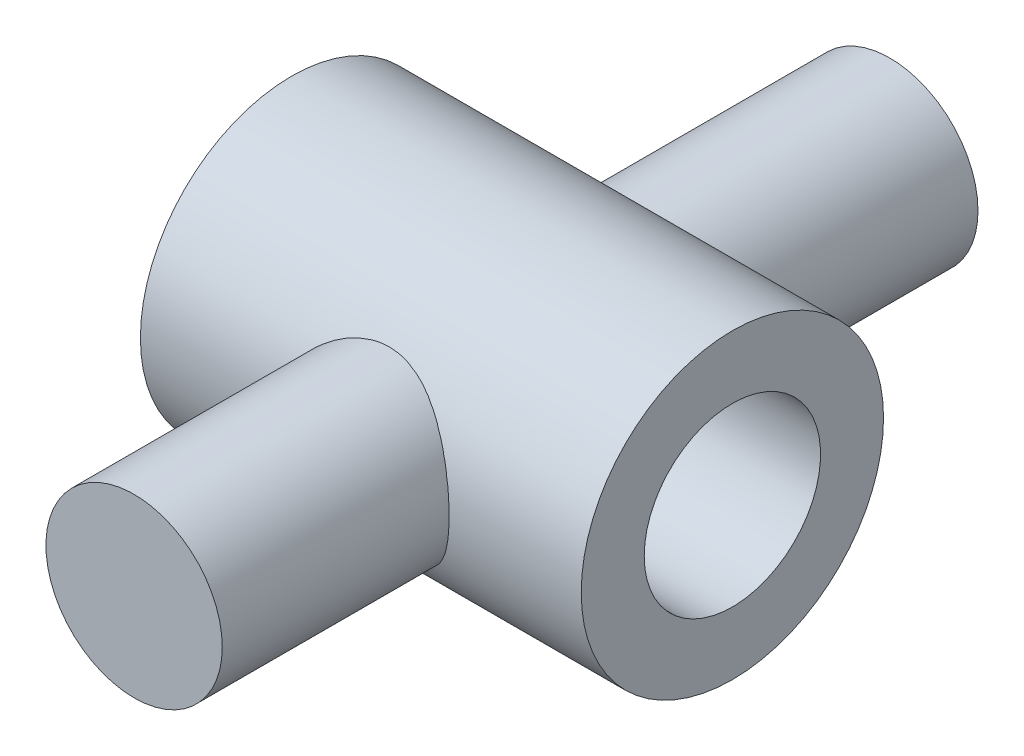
ISO-10303-21;
HEADER;
FILE_DESCRIPTION(('STEP AP214'),'2;1');
FILE_NAME('part.step','',(''),(''),'','','');
FILE_SCHEMA(('AUTOMOTIVE_DESIGN { 1 0 10303 214 1 1 1 1 }'));
ENDSEC;
DATA;
#1=APPLICATION_CONTEXT('core data for automotive mechanical design processes');
#2=APPLICATION_PROTOCOL_DEFINITION('international standard','automotive_design',2000,#1);
#3=PRODUCT_CONTEXT('',#1,'mechanical');
#4=PRODUCT('Part','Part','',(#3));
#5=PRODUCT_RELATED_PRODUCT_CATEGORY('part','',(#4));
#6=PRODUCT_DEFINITION_FORMATION('','',#4);
#7=PRODUCT_DEFINITION_CONTEXT('part definition',#1,'design');
#8=PRODUCT_DEFINITION('design','',#6,#7);
#9=PRODUCT_DEFINITION_SHAPE('','',#8);
#10=(LENGTH_UNIT() NAMED_UNIT(*) SI_UNIT(.MILLI.,.METRE.));
#11=(NAMED_UNIT(*) PLANE_ANGLE_UNIT() SI_UNIT($,.RADIAN.));
#12=(NAMED_UNIT(*) SI_UNIT($,.STERADIAN.) SOLID_ANGLE_UNIT());
#13=UNCERTAINTY_MEASURE_WITH_UNIT(LENGTH_MEASURE(1.E-05),#10,'distance_accuracy_value','');
#14=(GEOMETRIC_REPRESENTATION_CONTEXT(3) GLOBAL_UNCERTAINTY_ASSIGNED_CONTEXT((#13)) GLOBAL_UNIT_ASSIGNED_CONTEXT((#10,
#11,#12)) REPRESENTATION_CONTEXT('',''));
#15=CARTESIAN_POINT('',(0.,0.,0.));
#16=DIRECTION('',(0.,0.,1.));
#17=DIRECTION('',(1.,0.,0.));
#18=AXIS2_PLACEMENT_3D('',#15,#16,#17);
#19=CARTESIAN_POINT('',(0.,0.,30.));
#20=DIRECTION('',(0.,0.,-1.));
#21=DIRECTION('',(-1.,0.,0.));
#22=AXIS2_PLACEMENT_3D('',#19,#20,#21);
#23=CYLINDRICAL_SURFACE('',#22,7.);
#24=CARTESIAN_POINT('',(0.,0.,0.));
#25=DIRECTION('',(-0.707106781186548,0.,-0.707106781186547));
#26=DIRECTION('',(0.707106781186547,0.,-0.707106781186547));
#27=AXIS2_PLACEMENT_3D('',#24,#25,#26);
#28=ELLIPSE('',#27,9.89949493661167,7.);
#29=CARTESIAN_POINT('',(0.,6.9999999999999,0.));
#30=VERTEX_POINT('',#29);
#31=CARTESIAN_POINT('',(0.,-7.00000000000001,0.));
#32=VERTEX_POINT('',#31);
#33=EDGE_CURVE('E57',#30,#32,#28,.T.);
#34=ORIENTED_EDGE('',*,*,#33,.T.);
#35=CARTESIAN_POINT('',(0.,0.,0.));
#36=DIRECTION('',(0.707106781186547,0.,-0.707106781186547));
#37=DIRECTION('',(-0.707106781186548,0.,-0.707106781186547));
#38=AXIS2_PLACEMENT_3D('',#35,#36,#37);
#39=ELLIPSE('',#38,9.89949493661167,7.);
#40=EDGE_CURVE('E50',#32,#30,#39,.T.);
#41=ORIENTED_EDGE('',*,*,#40,.T.);
#42=EDGE_LOOP('',(#34,#41));
#43=FACE_BOUND('',#42,.T.);
#44=CARTESIAN_POINT('',(0.,0.,-30.));
#45=DIRECTION('',(0.,0.,1.));
#46=DIRECTION('',(1.,0.,0.));
#47=AXIS2_PLACEMENT_3D('',#44,#45,#46);
#48=CIRCLE('',#47,7.);
#49=CARTESIAN_POINT('',(7.,0.,-30.));
#50=VERTEX_POINT('',#49);
#51=EDGE_CURVE('E12',#50,#50,#48,.T.);
#52=ORIENTED_EDGE('',*,*,#51,.T.);
#53=EDGE_LOOP('',(#52));
#54=FACE_BOUND('',#53,.T.);
#55=ADVANCED_FACE('F42',(#43,#54),#23,.T.);
#56=CARTESIAN_POINT('',(0.,0.,-30.));
#57=DIRECTION('',(0.,0.,1.));
#58=DIRECTION('',(1.,0.,0.));
#59=AXIS2_PLACEMENT_3D('',#56,#57,#58);
#60=PLANE('',#59);
#61=ORIENTED_EDGE('',*,*,#51,.F.);
#62=EDGE_LOOP('',(#61));
#63=FACE_BOUND('',#62,.T.);
#64=ADVANCED_FACE('F62',(#63),#60,.F.);
#65=CARTESIAN_POINT('',(-17.5,-2.77555756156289E-13,0.));
#66=DIRECTION('',(1.,0.,0.));
#67=DIRECTION('',(0.,0.,-1.));
#68=AXIS2_PLACEMENT_3D('',#65,#66,#67);
#69=CYLINDRICAL_SURFACE('',#68,7.);
#70=ORIENTED_EDGE('',*,*,#33,.F.);
#71=ORIENTED_EDGE('',*,*,#40,.F.);
#72=EDGE_LOOP('',(#70,#71));
#73=FACE_BOUND('',#72,.T.);
#74=ADVANCED_FACE('F44',(#73),#69,.F.);
#75=CLOSED_SHELL('',(#55,#64,#74));
#76=MANIFOLD_SOLID_BREP('B2',#75);
#77=CARTESIAN_POINT('',(0.,0.,30.));
#78=DIRECTION('',(0.,0.,1.));
#79=DIRECTION('',(1.,0.,0.));
#80=AXIS2_PLACEMENT_3D('',#77,#78,#79);
#81=PLANE('',#80);
#82=CARTESIAN_POINT('',(0.,0.,30.));
#83=DIRECTION('',(0.,0.,1.));
#84=DIRECTION('',(1.,0.,0.));
#85=AXIS2_PLACEMENT_3D('',#82,#83,#84);
#86=CIRCLE('',#85,7.);
#87=CARTESIAN_POINT('',(7.,0.,30.));
#88=VERTEX_POINT('',#87);
#89=EDGE_CURVE('E106',#88,#88,#86,.T.);
#90=ORIENTED_EDGE('',*,*,#89,.T.);
#91=EDGE_LOOP('',(#90));
#92=FACE_BOUND('',#91,.T.);
#93=ADVANCED_FACE('F90',(#92),#81,.T.);
#94=CARTESIAN_POINT('',(0.,0.,30.));
#95=DIRECTION('',(0.,0.,-1.));
#96=DIRECTION('',(-1.,0.,0.));
#97=AXIS2_PLACEMENT_3D('',#94,#95,#96);
#98=CYLINDRICAL_SURFACE('',#97,7.);
#99=ORIENTED_EDGE('',*,*,#89,.F.);
#100=EDGE_LOOP('',(#99));
#101=FACE_BOUND('',#100,.T.);
#102=CARTESIAN_POINT('',(0.,0.,0.));
#103=DIRECTION('',(-0.707106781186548,0.,-0.707106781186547));
#104=DIRECTION('',(0.707106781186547,0.,-0.707106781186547));
#105=AXIS2_PLACEMENT_3D('',#102,#103,#104);
#106=ELLIPSE('',#105,9.89949493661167,7.);
#107=CARTESIAN_POINT('',(0.,6.9999999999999,0.));
#108=VERTEX_POINT('',#107);
#109=CARTESIAN_POINT('',(0.,-7.00000000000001,0.));
#110=VERTEX_POINT('',#109);
#111=EDGE_CURVE('E98',#108,#110,#106,.F.);
#112=ORIENTED_EDGE('',*,*,#111,.T.);
#113=CARTESIAN_POINT('',(0.,0.,0.));
#114=DIRECTION('',(0.707106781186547,0.,-0.707106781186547));
#115=DIRECTION('',(-0.707106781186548,0.,-0.707106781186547));
#116=AXIS2_PLACEMENT_3D('',#113,#114,#115);
#117=ELLIPSE('',#116,9.89949493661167,7.);
#118=EDGE_CURVE('E40',#110,#108,#117,.F.);
#119=ORIENTED_EDGE('',*,*,#118,.T.);
#120=EDGE_LOOP('',(#112,#119));
#121=FACE_BOUND('',#120,.T.);
#122=ADVANCED_FACE('F92',(#101,#121),#98,.T.);
#123=CARTESIAN_POINT('',(-17.5,-2.77555756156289E-13,0.));
#124=DIRECTION('',(1.,0.,0.));
#125=DIRECTION('',(0.,0.,-1.));
#126=AXIS2_PLACEMENT_3D('',#123,#124,#125);
#127=CYLINDRICAL_SURFACE('',#126,7.);
#128=ORIENTED_EDGE('',*,*,#111,.F.);
#129=ORIENTED_EDGE('',*,*,#118,.F.);
#130=EDGE_LOOP('',(#128,#129));
#131=FACE_BOUND('',#130,.T.);
#132=ADVANCED_FACE('F104',(#131),#127,.F.);
#133=CLOSED_SHELL('',(#93,#122,#132));
#134=MANIFOLD_SOLID_BREP('B6',#133);
#135=CARTESIAN_POINT('',(-17.5000000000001,11.9999999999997,0.));
#136=DIRECTION('',(1.,0.,0.));
#137=DIRECTION('',(0.,0.,-1.));
#138=AXIS2_PLACEMENT_3D('',#135,#136,#137);
#139=PLANE('',#138);
#140=CARTESIAN_POINT('',(-17.5,-2.77555756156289E-13,0.));
#141=DIRECTION('',(-1.,0.,0.));
#142=DIRECTION('',(0.,0.,1.));
#143=AXIS2_PLACEMENT_3D('',#140,#141,#142);
#144=CIRCLE('',#143,7.);
#145=CARTESIAN_POINT('',(-17.5,-2.77555756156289E-13,7.));
#146=VERTEX_POINT('',#145);
#147=EDGE_CURVE('E89',#146,#146,#144,.T.);
#148=ORIENTED_EDGE('',*,*,#147,.F.);
#149=EDGE_LOOP('',(#148));
#150=FACE_BOUND('',#149,.T.);
#151=CARTESIAN_POINT('',(-17.5,-2.77555756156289E-13,0.));
#152=DIRECTION('',(-1.,0.,0.));
#153=DIRECTION('',(0.,0.,1.));
#154=AXIS2_PLACEMENT_3D('',#151,#152,#153);
#155=CIRCLE('',#154,12.);
#156=CARTESIAN_POINT('',(-17.5,-2.77555756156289E-13,12.));
#157=VERTEX_POINT('',#156);
#158=EDGE_CURVE('E145',#157,#157,#155,.T.);
#159=ORIENTED_EDGE('',*,*,#158,.T.);
#160=EDGE_LOOP('',(#159));
#161=FACE_BOUND('',#160,.T.);
#162=ADVANCED_FACE('F131',(#150,#161),#139,.F.);
#163=CARTESIAN_POINT('',(0.,0.,0.));
#164=DIRECTION('',(-1.,0.,0.));
#165=DIRECTION('',(0.,0.,1.));
#166=AXIS2_PLACEMENT_3D('',#163,#164,#165);
#167=CYLINDRICAL_SURFACE('',#166,7.);
#168=CARTESIAN_POINT('',(17.5000000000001,0.,0.));
#169=DIRECTION('',(-1.,0.,0.));
#170=DIRECTION('',(0.,0.,1.));
#171=AXIS2_PLACEMENT_3D('',#168,#169,#170);
#172=CIRCLE('',#171,7.);
#173=CARTESIAN_POINT('',(17.5000000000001,0.,7.));
#174=VERTEX_POINT('',#173);
#175=EDGE_CURVE('E137',#174,#174,#172,.T.);
#176=ORIENTED_EDGE('',*,*,#175,.F.);
#177=EDGE_LOOP('',(#176));
#178=FACE_BOUND('',#177,.T.);
#179=ORIENTED_EDGE('',*,*,#147,.T.);
#180=EDGE_LOOP('',(#179));
#181=FACE_BOUND('',#180,.T.);
#182=ADVANCED_FACE('F160',(#178,#181),#167,.F.);
#183=CARTESIAN_POINT('',(17.5,7.00000000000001,0.));
#184=DIRECTION('',(-1.,0.,0.));
#185=DIRECTION('',(0.,0.,1.));
#186=AXIS2_PLACEMENT_3D('',#183,#184,#185);
#187=PLANE('',#186);
#188=CARTESIAN_POINT('',(17.5000000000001,0.,0.));
#189=DIRECTION('',(-1.,0.,0.));
#190=DIRECTION('',(0.,0.,1.));
#191=AXIS2_PLACEMENT_3D('',#188,#189,#190);
#192=CIRCLE('',#191,12.);
#193=CARTESIAN_POINT('',(17.5000000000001,0.,12.));
#194=VERTEX_POINT('',#193);
#195=EDGE_CURVE('E141',#194,#194,#192,.T.);
#196=ORIENTED_EDGE('',*,*,#195,.F.);
#197=EDGE_LOOP('',(#196));
#198=FACE_BOUND('',#197,.T.);
#199=ORIENTED_EDGE('',*,*,#175,.T.);
#200=EDGE_LOOP('',(#199));
#201=FACE_BOUND('',#200,.T.);
#202=ADVANCED_FACE('F155',(#198,#201),#187,.F.);
#203=CARTESIAN_POINT('',(0.,0.,0.));
#204=DIRECTION('',(-1.,0.,0.));
#205=DIRECTION('',(0.,0.,1.));
#206=AXIS2_PLACEMENT_3D('',#203,#204,#205);
#207=CYLINDRICAL_SURFACE('',#206,12.);
#208=ORIENTED_EDGE('',*,*,#158,.F.);
#209=EDGE_LOOP('',(#208));
#210=FACE_BOUND('',#209,.T.);
#211=ORIENTED_EDGE('',*,*,#195,.T.);
#212=EDGE_LOOP('',(#211));
#213=FACE_BOUND('',#212,.T.);
#214=ADVANCED_FACE('F152',(#210,#213),#207,.T.);
#215=CLOSED_SHELL('',(#162,#182,#202,#214));
#216=MANIFOLD_SOLID_BREP('B34',#215);
#217=ADVANCED_BREP_SHAPE_REPRESENTATION('',(#18,#76,#134,#216),#14);
#218=SHAPE_DEFINITION_REPRESENTATION(#9,#217);
ENDSEC;
END-ISO-10303-21;
